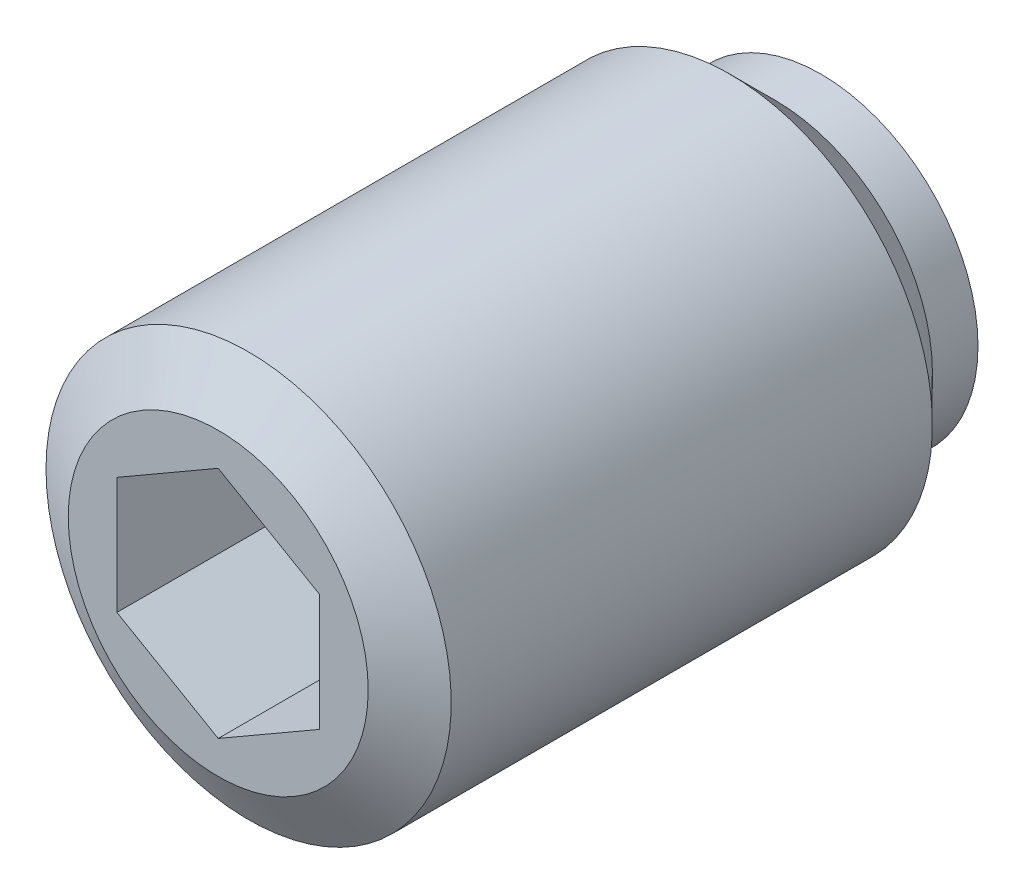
ISO-10303-21;
HEADER;
FILE_DESCRIPTION(('STEP AP214'),'2;1');
FILE_NAME('part.step','',(''),(''),'','','');
FILE_SCHEMA(('AUTOMOTIVE_DESIGN { 1 0 10303 214 1 1 1 1 }'));
ENDSEC;
DATA;
#1=APPLICATION_CONTEXT('core data for automotive mechanical design processes');
#2=APPLICATION_PROTOCOL_DEFINITION('international standard','automotive_design',2000,#1);
#3=PRODUCT_CONTEXT('',#1,'mechanical');
#4=PRODUCT('Part','Part','',(#3));
#5=PRODUCT_RELATED_PRODUCT_CATEGORY('part','',(#4));
#6=PRODUCT_DEFINITION_FORMATION('','',#4);
#7=PRODUCT_DEFINITION_CONTEXT('part definition',#1,'design');
#8=PRODUCT_DEFINITION('design','',#6,#7);
#9=PRODUCT_DEFINITION_SHAPE('','',#8);
#10=(LENGTH_UNIT() NAMED_UNIT(*) SI_UNIT(.MILLI.,.METRE.));
#11=(NAMED_UNIT(*) PLANE_ANGLE_UNIT() SI_UNIT($,.RADIAN.));
#12=(NAMED_UNIT(*) SI_UNIT($,.STERADIAN.) SOLID_ANGLE_UNIT());
#13=UNCERTAINTY_MEASURE_WITH_UNIT(LENGTH_MEASURE(1.E-05),#10,'distance_accuracy_value','');
#14=(GEOMETRIC_REPRESENTATION_CONTEXT(3) GLOBAL_UNCERTAINTY_ASSIGNED_CONTEXT((#13)) GLOBAL_UNIT_ASSIGNED_CONTEXT((#10,
#11,#12)) REPRESENTATION_CONTEXT('',''));
#15=CARTESIAN_POINT('',(0.,0.,0.));
#16=DIRECTION('',(0.,0.,1.));
#17=DIRECTION('',(1.,0.,0.));
#18=AXIS2_PLACEMENT_3D('',#15,#16,#17);
#19=CARTESIAN_POINT('',(0.,2.09621086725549,0.));
#20=DIRECTION('',(0.,0.,1.));
#21=DIRECTION('',(-1.,0.,0.));
#22=AXIS2_PLACEMENT_3D('',#19,#20,#21);
#23=PLANE('',#22);
#24=CARTESIAN_POINT('',(0.,0.,0.));
#25=DIRECTION('',(0.,0.,1.));
#26=DIRECTION('',(-1.,0.,0.));
#27=AXIS2_PLACEMENT_3D('',#24,#25,#26);
#28=CIRCLE('',#27,2.09621086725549);
#29=CARTESIAN_POINT('',(0.,2.09621086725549,0.));
#30=VERTEX_POINT('',#29);
#31=EDGE_CURVE('E9',#30,#30,#28,.T.);
#32=ORIENTED_EDGE('',*,*,#31,.F.);
#33=EDGE_LOOP('',(#32));
#34=FACE_BOUND('',#33,.T.);
#35=ADVANCED_FACE('F14',(#34),#23,.F.);
#36=CARTESIAN_POINT('',(0.,0.,1.78));
#37=DIRECTION('',(0.,0.,1.));
#38=DIRECTION('',(0.,1.,0.));
#39=AXIS2_PLACEMENT_3D('',#36,#37,#38);
#40=SPHERICAL_SURFACE('',#39,2.75);
#41=CARTESIAN_POINT('',(0.,0.,0.5));
#42=DIRECTION('',(0.,0.,1.));
#43=DIRECTION('',(-1.,0.,0.));
#44=AXIS2_PLACEMENT_3D('',#41,#42,#43);
#45=CIRCLE('',#44,2.43394741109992);
#46=CARTESIAN_POINT('',(0.,2.43394741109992,0.5));
#47=VERTEX_POINT('',#46);
#48=EDGE_CURVE('E21',#47,#47,#45,.T.);
#49=CARTESIAN_POINT('',(0.,2.43394741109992,0.5));
#50=CARTESIAN_POINT('',(0.,2.43101603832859,0.494425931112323));
#51=CARTESIAN_POINT('',(0.,2.42806551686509,0.488861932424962));
#52=CARTESIAN_POINT('',(0.,2.42212631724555,0.477754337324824));
#53=CARTESIAN_POINT('',(0.,2.41913763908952,0.472210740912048));
#54=CARTESIAN_POINT('',(0.,2.41312226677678,0.46114421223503));
#55=CARTESIAN_POINT('',(0.,2.41009557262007,0.455621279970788));
#56=CARTESIAN_POINT('',(0.,2.40400431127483,0.444596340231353));
#57=CARTESIAN_POINT('',(0.,2.40093974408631,0.439094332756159));
#58=CARTESIAN_POINT('',(0.,2.39477288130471,0.428111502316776));
#59=CARTESIAN_POINT('',(0.,2.39167058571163,0.422630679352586));
#60=CARTESIAN_POINT('',(0.,2.38542841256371,0.411690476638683));
#61=CARTESIAN_POINT('',(0.,2.38228853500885,0.40623109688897));
#62=CARTESIAN_POINT('',(0.,2.37597134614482,0.39533403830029));
#63=CARTESIAN_POINT('',(0.,2.37279403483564,0.389896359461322));
#64=CARTESIAN_POINT('',(0.,2.36640212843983,0.379042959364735));
#65=CARTESIAN_POINT('',(0.,2.3631875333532,0.373627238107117));
#66=CARTESIAN_POINT('',(0.,2.35672121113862,0.362818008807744));
#67=CARTESIAN_POINT('',(0.,2.35346948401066,0.35742450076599));
#68=CARTESIAN_POINT('',(0.,2.3469290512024,0.346659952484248));
#69=CARTESIAN_POINT('',(0.,2.3436403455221,0.341288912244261));
#70=CARTESIAN_POINT('',(0.,2.3370261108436,0.330569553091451));
#71=CARTESIAN_POINT('',(0.,2.33370058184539,0.325221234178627));
#72=CARTESIAN_POINT('',(0.,2.32701285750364,0.314547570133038));
#73=CARTESIAN_POINT('',(0.,2.32365066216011,0.309222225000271));
#74=CARTESIAN_POINT('',(0.,2.31688976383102,0.298594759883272));
#75=CARTESIAN_POINT('',(0.,2.31349106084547,0.293292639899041));
#76=CARTESIAN_POINT('',(0.,2.30665730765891,0.28271187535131));
#77=CARTESIAN_POINT('',(0.,2.30322225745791,0.277433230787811));
#78=CARTESIAN_POINT('',(0.,2.29631597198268,0.266899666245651));
#79=CARTESIAN_POINT('',(0.,2.29284473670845,0.261644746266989));
#80=CARTESIAN_POINT('',(0.,2.28586624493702,0.251158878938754));
#81=CARTESIAN_POINT('',(0.,2.28235898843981,0.24592793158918));
#82=CARTESIAN_POINT('',(0.,2.27530861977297,0.235490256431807));
#83=CARTESIAN_POINT('',(0.,2.27176550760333,0.230283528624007));
#84=CARTESIAN_POINT('',(0.,2.26464359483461,0.219894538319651));
#85=CARTESIAN_POINT('',(0.,2.26106479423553,0.214712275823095));
#86=CARTESIAN_POINT('',(0.,2.25387167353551,0.204372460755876));
#87=CARTESIAN_POINT('',(0.,2.25025735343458,0.199214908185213));
#88=CARTESIAN_POINT('',(0.,2.24299336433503,0.188924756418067));
#89=CARTESIAN_POINT('',(0.,2.23934369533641,0.183792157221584));
#90=CARTESIAN_POINT('',(0.,2.23200918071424,0.173552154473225));
#91=CARTESIAN_POINT('',(0.,2.22832433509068,0.168444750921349));
#92=CARTESIAN_POINT('',(0.,2.22091964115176,0.158255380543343));
#93=CARTESIAN_POINT('',(0.,2.2171997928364,0.153173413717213));
#94=CARTESIAN_POINT('',(0.,2.20972526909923,0.143035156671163));
#95=CARTESIAN_POINT('',(0.,2.20597059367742,0.137978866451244));
#96=CARTESIAN_POINT('',(0.,2.19842659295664,0.127892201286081));
#97=CARTESIAN_POINT('',(0.,2.19463726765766,0.122861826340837));
#98=CARTESIAN_POINT('',(0.,2.18702414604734,0.112827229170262));
#99=CARTESIAN_POINT('',(0.,2.18320034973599,0.10782300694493));
#100=CARTESIAN_POINT('',(0.,2.17551846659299,0.0978409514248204));
#101=CARTESIAN_POINT('',(0.,2.17166037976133,0.0928631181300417));
#102=CARTESIAN_POINT('',(0.,2.16391009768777,0.0829340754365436));
#103=CARTESIAN_POINT('',(0.,2.16001790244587,0.0779828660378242));
#104=CARTESIAN_POINT('',(0.,2.15219958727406,0.0681073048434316));
#105=CARTESIAN_POINT('',(0.,2.14827346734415,0.0631829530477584));
#106=CARTESIAN_POINT('',(0.,2.14038748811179,0.0533613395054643));
#107=CARTESIAN_POINT('',(0.,2.13642762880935,0.0484640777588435));
#108=CARTESIAN_POINT('',(0.,2.12847435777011,0.0386968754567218));
#109=CARTESIAN_POINT('',(0.,2.12448094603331,0.0338269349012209));
#110=CARTESIAN_POINT('',(0.,2.11646075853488,0.024114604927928));
#111=CARTESIAN_POINT('',(0.,2.11243398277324,0.019272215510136));
#112=CARTESIAN_POINT('',(0.,2.10434725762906,0.0096152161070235));
#113=CARTESIAN_POINT('',(0.,2.10028730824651,0.00480060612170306));
#114=CARTESIAN_POINT('',(0.,2.09621086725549,0.));
#115=B_SPLINE_CURVE_WITH_KNOTS('',3,(#49,#50,#51,#52,#53,#54,#55,#56,#57,#58,#59,#60,#61,#62,
#63,#64,#65,#66,#67,#68,#69,#70,#71,#72,#73,#74,#75,#76,#77,#78,#79,#80,#81,#82,#83,#84,#85,#86,
#87,#88,#89,#90,#91,#92,#93,#94,#95,#96,#97,#98,#99,#100,#101,#102,#103,#104,#105,#106,#107,
#108,#109,#110,#111,#112,#113,#114),.UNSPECIFIED.,.F.,.F.,(4,2,2,2,2,2,2,2,2,2,2,2,2,2,2,2,2,2,
2,2,2,2,2,2,2,2,2,2,2,2,2,2,4),(0.,0.0188935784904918,0.0377871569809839,0.0566807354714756,
0.0755743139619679,0.0944678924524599,0.113361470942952,0.132255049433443,0.151148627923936,
0.170042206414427,0.188935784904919,0.207829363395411,0.226722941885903,0.245616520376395,
0.264510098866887,0.283403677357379,0.302297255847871,0.321190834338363,0.340084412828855,
0.358977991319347,0.377871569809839,0.396765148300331,0.415658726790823,0.434552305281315,
0.453445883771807,0.472339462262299,0.491233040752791,0.510126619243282,0.529020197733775,
0.547913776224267,0.566807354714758,0.58570093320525,0.604594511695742),.UNSPECIFIED.);
#116=EDGE_CURVE('BSEAM141',#47,#30,#115,.T.);
#117=ORIENTED_EDGE('',*,*,#48,.F.);
#118=ORIENTED_EDGE('',*,*,#31,.T.);
#119=ORIENTED_EDGE('',*,*,#116,.T.);
#120=ORIENTED_EDGE('',*,*,#116,.F.);
#121=EDGE_LOOP('',(#117,#119,#118,#120));
#122=FACE_BOUND('',#121,.T.);
#123=ADVANCED_FACE('F141',(#122),#40,.T.);
#124=CARTESIAN_POINT('',(0.,3.1,0.5));
#125=DIRECTION('',(0.,0.,1.));
#126=DIRECTION('',(-1.,0.,0.));
#127=AXIS2_PLACEMENT_3D('',#124,#125,#126);
#128=PLANE('',#127);
#129=CARTESIAN_POINT('',(0.,0.,0.5));
#130=DIRECTION('',(0.,0.,1.));
#131=DIRECTION('',(-1.,0.,0.));
#132=AXIS2_PLACEMENT_3D('',#129,#130,#131);
#133=CIRCLE('',#132,3.1);
#134=CARTESIAN_POINT('',(-3.1,0.,0.5));
#135=VERTEX_POINT('',#134);
#136=EDGE_CURVE('E134',#135,#135,#133,.T.);
#137=ORIENTED_EDGE('',*,*,#136,.F.);
#138=EDGE_LOOP('',(#137));
#139=FACE_BOUND('',#138,.T.);
#140=ORIENTED_EDGE('',*,*,#48,.T.);
#141=EDGE_LOOP('',(#140));
#142=FACE_BOUND('',#141,.T.);
#143=ADVANCED_FACE('F139',(#139,#142),#128,.F.);
#144=CARTESIAN_POINT('',(0.,0.,13.7950749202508));
#145=DIRECTION('',(0.,0.,1.));
#146=DIRECTION('',(-1.,0.,0.));
#147=AXIS2_PLACEMENT_3D('',#144,#145,#146);
#148=CYLINDRICAL_SURFACE('',#147,3.1);
#149=CARTESIAN_POINT('',(0.,0.,1.4));
#150=DIRECTION('',(0.,0.,1.));
#151=DIRECTION('',(-1.,0.,0.));
#152=AXIS2_PLACEMENT_3D('',#149,#150,#151);
#153=CIRCLE('',#152,3.1);
#154=CARTESIAN_POINT('',(-3.1,0.,1.4));
#155=VERTEX_POINT('',#154);
#156=EDGE_CURVE('E131',#155,#155,#153,.T.);
#157=ORIENTED_EDGE('',*,*,#156,.F.);
#158=EDGE_LOOP('',(#157));
#159=FACE_BOUND('',#158,.T.);
#160=ORIENTED_EDGE('',*,*,#136,.T.);
#161=EDGE_LOOP('',(#160));
#162=FACE_BOUND('',#161,.T.);
#163=ADVANCED_FACE('F164',(#159,#162),#148,.T.);
#164=CARTESIAN_POINT('',(0.,0.,1.4));
#165=DIRECTION('',(0.,0.,1.));
#166=DIRECTION('',(-1.,0.,0.));
#167=AXIS2_PLACEMENT_3D('',#164,#165,#166);
#168=CONICAL_SURFACE('',#167,3.1,0.78539816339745);
#169=CARTESIAN_POINT('',(0.,0.,2.3));
#170=DIRECTION('',(0.,0.,1.));
#171=DIRECTION('',(-1.,0.,0.));
#172=AXIS2_PLACEMENT_3D('',#169,#170,#171);
#173=CIRCLE('',#172,4.);
#174=CARTESIAN_POINT('',(-4.,0.,2.3));
#175=VERTEX_POINT('',#174);
#176=EDGE_CURVE('E128',#175,#175,#173,.T.);
#177=ORIENTED_EDGE('',*,*,#176,.F.);
#178=EDGE_LOOP('',(#177));
#179=FACE_BOUND('',#178,.T.);
#180=ORIENTED_EDGE('',*,*,#156,.T.);
#181=EDGE_LOOP('',(#180));
#182=FACE_BOUND('',#181,.T.);
#183=ADVANCED_FACE('F173',(#179,#182),#168,.T.);
#184=CARTESIAN_POINT('',(0.,0.,13.7950749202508));
#185=DIRECTION('',(0.,0.,1.));
#186=DIRECTION('',(-1.,0.,0.));
#187=AXIS2_PLACEMENT_3D('',#184,#185,#186);
#188=CYLINDRICAL_SURFACE('',#187,4.);
#189=CARTESIAN_POINT('',(0.,0.,11.8));
#190=DIRECTION('',(0.,0.,1.));
#191=DIRECTION('',(-1.,0.,0.));
#192=AXIS2_PLACEMENT_3D('',#189,#190,#191);
#193=CIRCLE('',#192,4.);
#194=CARTESIAN_POINT('',(-4.,0.,11.8));
#195=VERTEX_POINT('',#194);
#196=EDGE_CURVE('E125',#195,#195,#193,.T.);
#197=ORIENTED_EDGE('',*,*,#196,.F.);
#198=EDGE_LOOP('',(#197));
#199=FACE_BOUND('',#198,.T.);
#200=ORIENTED_EDGE('',*,*,#176,.T.);
#201=EDGE_LOOP('',(#200));
#202=FACE_BOUND('',#201,.T.);
#203=ADVANCED_FACE('F182',(#199,#202),#188,.T.);
#204=CARTESIAN_POINT('',(0.,0.,11.8));
#205=DIRECTION('',(0.,0.,-1.));
#206=DIRECTION('',(1.,0.,0.));
#207=AXIS2_PLACEMENT_3D('',#204,#205,#206);
#208=CONICAL_SURFACE('',#207,4.,1.04719755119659);
#209=CARTESIAN_POINT('',(0.,0.,12.4));
#210=DIRECTION('',(0.,0.,1.));
#211=DIRECTION('',(-1.,0.,0.));
#212=AXIS2_PLACEMENT_3D('',#209,#210,#211);
#213=CIRCLE('',#212,2.9607695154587);
#214=CARTESIAN_POINT('',(-2.9607695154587,0.,12.4));
#215=VERTEX_POINT('',#214);
#216=EDGE_CURVE('E116',#215,#215,#213,.T.);
#217=ORIENTED_EDGE('',*,*,#216,.F.);
#218=EDGE_LOOP('',(#217));
#219=FACE_BOUND('',#218,.T.);
#220=ORIENTED_EDGE('',*,*,#196,.T.);
#221=EDGE_LOOP('',(#220));
#222=FACE_BOUND('',#221,.T.);
#223=ADVANCED_FACE('F191',(#219,#222),#208,.T.);
#224=CARTESIAN_POINT('',(0.,0.,12.4));
#225=DIRECTION('',(0.,0.,-1.));
#226=DIRECTION('',(1.,0.,0.));
#227=AXIS2_PLACEMENT_3D('',#224,#225,#226);
#228=PLANE('',#227);
#229=DIRECTION('',(-0.866025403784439,-0.5,0.));
#230=VECTOR('',#229,1.);
#231=CARTESIAN_POINT('',(0.,2.30940107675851,12.4));
#232=LINE('',#231,#230);
#233=CARTESIAN_POINT('',(0.,2.30940107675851,12.4));
#234=VERTEX_POINT('',#233);
#235=CARTESIAN_POINT('',(-2.,1.15470053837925,12.4));
#236=VERTEX_POINT('',#235);
#237=EDGE_CURVE('E82',#234,#236,#232,.T.);
#238=ORIENTED_EDGE('',*,*,#237,.F.);
#239=DIRECTION('',(-0.866025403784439,0.5,0.));
#240=VECTOR('',#239,1.);
#241=CARTESIAN_POINT('',(2.,1.15470053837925,12.4));
#242=LINE('',#241,#240);
#243=CARTESIAN_POINT('',(2.,1.15470053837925,12.4));
#244=VERTEX_POINT('',#243);
#245=EDGE_CURVE('E28',#244,#234,#242,.T.);
#246=ORIENTED_EDGE('',*,*,#245,.F.);
#247=DIRECTION('',(0.,1.,0.));
#248=VECTOR('',#247,1.);
#249=CARTESIAN_POINT('',(2.,-1.15470053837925,12.4));
#250=LINE('',#249,#248);
#251=CARTESIAN_POINT('',(2.,-1.15470053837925,12.4));
#252=VERTEX_POINT('',#251);
#253=EDGE_CURVE('E98',#252,#244,#250,.T.);
#254=ORIENTED_EDGE('',*,*,#253,.F.);
#255=DIRECTION('',(0.866025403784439,0.5,0.));
#256=VECTOR('',#255,1.);
#257=CARTESIAN_POINT('',(0.,-2.30940107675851,12.4));
#258=LINE('',#257,#256);
#259=CARTESIAN_POINT('',(0.,-2.30940107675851,12.4));
#260=VERTEX_POINT('',#259);
#261=EDGE_CURVE('E92',#260,#252,#258,.T.);
#262=ORIENTED_EDGE('',*,*,#261,.F.);
#263=DIRECTION('',(0.866025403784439,-0.5,0.));
#264=VECTOR('',#263,1.);
#265=CARTESIAN_POINT('',(-2.,-1.15470053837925,12.4));
#266=LINE('',#265,#264);
#267=CARTESIAN_POINT('',(-2.,-1.15470053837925,12.4));
#268=VERTEX_POINT('',#267);
#269=EDGE_CURVE('E90',#268,#260,#266,.T.);
#270=ORIENTED_EDGE('',*,*,#269,.F.);
#271=DIRECTION('',(0.,-1.,0.));
#272=VECTOR('',#271,1.);
#273=CARTESIAN_POINT('',(-2.,1.15470053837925,12.4));
#274=LINE('',#273,#272);
#275=EDGE_CURVE('E71',#236,#268,#274,.T.);
#276=ORIENTED_EDGE('',*,*,#275,.F.);
#277=EDGE_LOOP('',(#238,#246,#254,#262,#270,#276));
#278=FACE_BOUND('',#277,.T.);
#279=ORIENTED_EDGE('',*,*,#216,.T.);
#280=EDGE_LOOP('',(#279));
#281=FACE_BOUND('',#280,.T.);
#282=ADVANCED_FACE('F86',(#278,#281),#228,.F.);
#283=CARTESIAN_POINT('',(2.,1.15470053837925,8.4));
#284=DIRECTION('',(0.5,0.866025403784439,0.));
#285=DIRECTION('',(0.866025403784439,-0.5,0.));
#286=AXIS2_PLACEMENT_3D('',#283,#284,#285);
#287=PLANE('',#286);
#288=ORIENTED_EDGE('',*,*,#245,.T.);
#289=DIRECTION('',(0.,0.,1.));
#290=VECTOR('',#289,1.);
#291=CARTESIAN_POINT('',(0.,2.30940107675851,8.4));
#292=LINE('',#291,#290);
#293=CARTESIAN_POINT('',(0.,2.30940107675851,8.4));
#294=VERTEX_POINT('',#293);
#295=EDGE_CURVE('E79',#294,#234,#292,.T.);
#296=ORIENTED_EDGE('',*,*,#295,.F.);
#297=DIRECTION('',(-0.866025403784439,0.5,0.));
#298=VECTOR('',#297,1.);
#299=CARTESIAN_POINT('',(2.,1.15470053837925,8.4));
#300=LINE('',#299,#298);
#301=CARTESIAN_POINT('',(2.,1.15470053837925,8.4));
#302=VERTEX_POINT('',#301);
#303=EDGE_CURVE('E100',#302,#294,#300,.T.);
#304=ORIENTED_EDGE('',*,*,#303,.F.);
#305=DIRECTION('',(0.,0.,1.));
#306=VECTOR('',#305,1.);
#307=CARTESIAN_POINT('',(2.,1.15470053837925,8.4));
#308=LINE('',#307,#306);
#309=EDGE_CURVE('E35',#302,#244,#308,.T.);
#310=ORIENTED_EDGE('',*,*,#309,.T.);
#311=EDGE_LOOP('',(#288,#296,#304,#310));
#312=FACE_BOUND('',#311,.T.);
#313=ADVANCED_FACE('F208',(#312),#287,.F.);
#314=CARTESIAN_POINT('',(2.,-1.15470053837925,8.4));
#315=DIRECTION('',(1.,0.,0.));
#316=DIRECTION('',(0.,0.,1.));
#317=AXIS2_PLACEMENT_3D('',#314,#315,#316);
#318=PLANE('',#317);
#319=ORIENTED_EDGE('',*,*,#253,.T.);
#320=ORIENTED_EDGE('',*,*,#309,.F.);
#321=DIRECTION('',(0.,1.,0.));
#322=VECTOR('',#321,1.);
#323=CARTESIAN_POINT('',(2.,-1.15470053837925,8.4));
#324=LINE('',#323,#322);
#325=CARTESIAN_POINT('',(2.,-1.15470053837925,8.4));
#326=VERTEX_POINT('',#325);
#327=EDGE_CURVE('E112',#326,#302,#324,.T.);
#328=ORIENTED_EDGE('',*,*,#327,.F.);
#329=DIRECTION('',(0.,0.,1.));
#330=VECTOR('',#329,1.);
#331=CARTESIAN_POINT('',(2.,-1.15470053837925,8.4));
#332=LINE('',#331,#330);
#333=EDGE_CURVE('E117',#326,#252,#332,.T.);
#334=ORIENTED_EDGE('',*,*,#333,.T.);
#335=EDGE_LOOP('',(#319,#320,#328,#334));
#336=FACE_BOUND('',#335,.T.);
#337=ADVANCED_FACE('F216',(#336),#318,.F.);
#338=CARTESIAN_POINT('',(0.,-2.30940107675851,8.4));
#339=DIRECTION('',(0.5,-0.866025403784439,0.));
#340=DIRECTION('',(-0.866025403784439,-0.5,0.));
#341=AXIS2_PLACEMENT_3D('',#338,#339,#340);
#342=PLANE('',#341);
#343=ORIENTED_EDGE('',*,*,#261,.T.);
#344=ORIENTED_EDGE('',*,*,#333,.F.);
#345=DIRECTION('',(0.866025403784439,0.5,0.));
#346=VECTOR('',#345,1.);
#347=CARTESIAN_POINT('',(0.,-2.30940107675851,8.4));
#348=LINE('',#347,#346);
#349=CARTESIAN_POINT('',(0.,-2.30940107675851,8.4));
#350=VERTEX_POINT('',#349);
#351=EDGE_CURVE('E109',#350,#326,#348,.T.);
#352=ORIENTED_EDGE('',*,*,#351,.F.);
#353=DIRECTION('',(0.,0.,1.));
#354=VECTOR('',#353,1.);
#355=CARTESIAN_POINT('',(0.,-2.30940107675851,8.4));
#356=LINE('',#355,#354);
#357=EDGE_CURVE('E119',#350,#260,#356,.T.);
#358=ORIENTED_EDGE('',*,*,#357,.T.);
#359=EDGE_LOOP('',(#343,#344,#352,#358));
#360=FACE_BOUND('',#359,.T.);
#361=ADVANCED_FACE('F224',(#360),#342,.F.);
#362=CARTESIAN_POINT('',(-2.,-1.15470053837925,8.4));
#363=DIRECTION('',(-0.5,-0.866025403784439,0.));
#364=DIRECTION('',(-0.866025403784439,0.5,0.));
#365=AXIS2_PLACEMENT_3D('',#362,#363,#364);
#366=PLANE('',#365);
#367=ORIENTED_EDGE('',*,*,#269,.T.);
#368=ORIENTED_EDGE('',*,*,#357,.F.);
#369=DIRECTION('',(0.866025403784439,-0.5,0.));
#370=VECTOR('',#369,1.);
#371=CARTESIAN_POINT('',(-2.,-1.15470053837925,8.4));
#372=LINE('',#371,#370);
#373=CARTESIAN_POINT('',(-2.,-1.15470053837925,8.4));
#374=VERTEX_POINT('',#373);
#375=EDGE_CURVE('E106',#374,#350,#372,.T.);
#376=ORIENTED_EDGE('',*,*,#375,.F.);
#377=DIRECTION('',(0.,0.,1.));
#378=VECTOR('',#377,1.);
#379=CARTESIAN_POINT('',(-2.,-1.15470053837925,8.4));
#380=LINE('',#379,#378);
#381=EDGE_CURVE('E78',#374,#268,#380,.T.);
#382=ORIENTED_EDGE('',*,*,#381,.T.);
#383=EDGE_LOOP('',(#367,#368,#376,#382));
#384=FACE_BOUND('',#383,.T.);
#385=ADVANCED_FACE('F232',(#384),#366,.F.);
#386=CARTESIAN_POINT('',(-2.,1.15470053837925,8.4));
#387=DIRECTION('',(-1.,0.,0.));
#388=DIRECTION('',(0.,1.,0.));
#389=AXIS2_PLACEMENT_3D('',#386,#387,#388);
#390=PLANE('',#389);
#391=ORIENTED_EDGE('',*,*,#275,.T.);
#392=ORIENTED_EDGE('',*,*,#381,.F.);
#393=DIRECTION('',(0.,-1.,0.));
#394=VECTOR('',#393,1.);
#395=CARTESIAN_POINT('',(-2.,1.15470053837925,8.4));
#396=LINE('',#395,#394);
#397=CARTESIAN_POINT('',(-2.,1.15470053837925,8.4));
#398=VERTEX_POINT('',#397);
#399=EDGE_CURVE('E74',#398,#374,#396,.T.);
#400=ORIENTED_EDGE('',*,*,#399,.F.);
#401=DIRECTION('',(0.,0.,1.));
#402=VECTOR('',#401,1.);
#403=CARTESIAN_POINT('',(-2.,1.15470053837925,8.4));
#404=LINE('',#403,#402);
#405=EDGE_CURVE('E67',#398,#236,#404,.T.);
#406=ORIENTED_EDGE('',*,*,#405,.T.);
#407=EDGE_LOOP('',(#391,#392,#400,#406));
#408=FACE_BOUND('',#407,.T.);
#409=ADVANCED_FACE('F69',(#408),#390,.F.);
#410=CARTESIAN_POINT('',(0.,2.30940107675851,8.4));
#411=DIRECTION('',(-0.5,0.866025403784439,0.));
#412=DIRECTION('',(0.866025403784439,0.5,0.));
#413=AXIS2_PLACEMENT_3D('',#410,#411,#412);
#414=PLANE('',#413);
#415=ORIENTED_EDGE('',*,*,#237,.T.);
#416=ORIENTED_EDGE('',*,*,#405,.F.);
#417=DIRECTION('',(-0.866025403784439,-0.5,0.));
#418=VECTOR('',#417,1.);
#419=CARTESIAN_POINT('',(0.,2.30940107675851,8.4));
#420=LINE('',#419,#418);
#421=EDGE_CURVE('E103',#294,#398,#420,.T.);
#422=ORIENTED_EDGE('',*,*,#421,.F.);
#423=ORIENTED_EDGE('',*,*,#295,.T.);
#424=EDGE_LOOP('',(#415,#416,#422,#423));
#425=FACE_BOUND('',#424,.T.);
#426=ADVANCED_FACE('F83',(#425),#414,.F.);
#427=CARTESIAN_POINT('',(2.,1.15470053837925,8.4));
#428=DIRECTION('',(0.,0.,-1.));
#429=DIRECTION('',(1.,0.,0.));
#430=AXIS2_PLACEMENT_3D('',#427,#428,#429);
#431=PLANE('',#430);
#432=ORIENTED_EDGE('',*,*,#303,.T.);
#433=ORIENTED_EDGE('',*,*,#421,.T.);
#434=ORIENTED_EDGE('',*,*,#399,.T.);
#435=ORIENTED_EDGE('',*,*,#375,.T.);
#436=ORIENTED_EDGE('',*,*,#351,.T.);
#437=ORIENTED_EDGE('',*,*,#327,.T.);
#438=EDGE_LOOP('',(#432,#433,#434,#435,#436,#437));
#439=FACE_BOUND('',#438,.T.);
#440=ADVANCED_FACE('F256',(#439),#431,.F.);
#441=CLOSED_SHELL('',(#35,#123,#143,#163,#183,#203,#223,#282,#313,#337,#361,#385,#409,#426,#440));
#442=MANIFOLD_SOLID_BREP('B1',#441);
#443=ADVANCED_BREP_SHAPE_REPRESENTATION('',(#18,#442),#14);
#444=SHAPE_DEFINITION_REPRESENTATION(#9,#443);
ENDSEC;
END-ISO-10303-21;
